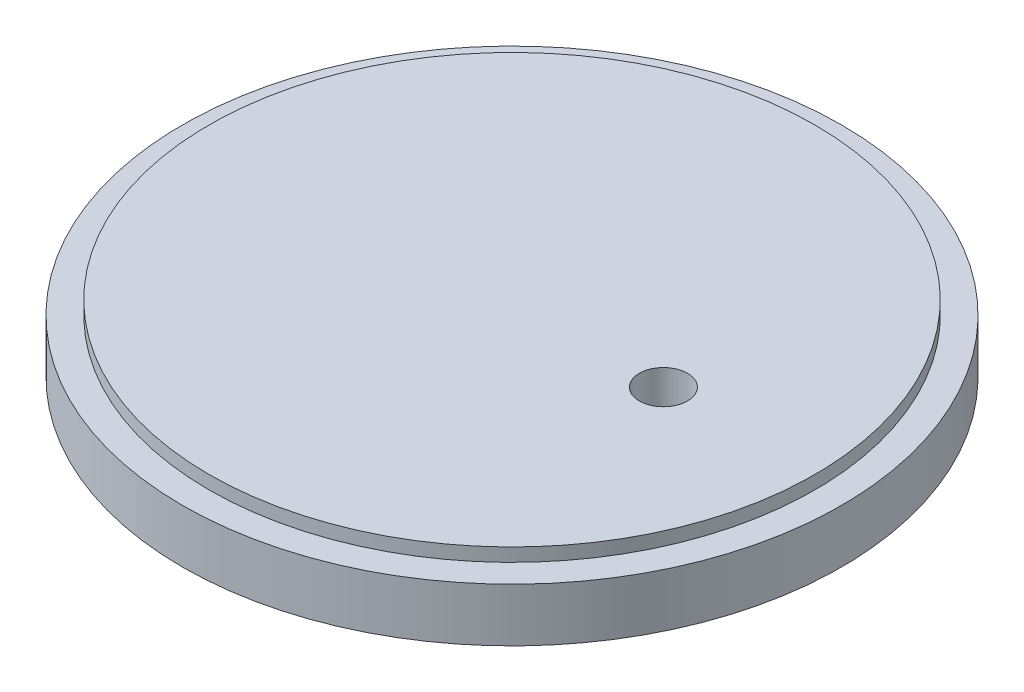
ISO-10303-21;
HEADER;
FILE_DESCRIPTION(('STEP AP214'),'2;1');
FILE_NAME('part.step','',(''),(''),'','','');
FILE_SCHEMA(('AUTOMOTIVE_DESIGN { 1 0 10303 214 1 1 1 1 }'));
ENDSEC;
DATA;
#1=APPLICATION_CONTEXT('core data for automotive mechanical design processes');
#2=APPLICATION_PROTOCOL_DEFINITION('international standard','automotive_design',2000,#1);
#3=PRODUCT_CONTEXT('',#1,'mechanical');
#4=PRODUCT('Part','Part','',(#3));
#5=PRODUCT_RELATED_PRODUCT_CATEGORY('part','',(#4));
#6=PRODUCT_DEFINITION_FORMATION('','',#4);
#7=PRODUCT_DEFINITION_CONTEXT('part definition',#1,'design');
#8=PRODUCT_DEFINITION('design','',#6,#7);
#9=PRODUCT_DEFINITION_SHAPE('','',#8);
#10=(LENGTH_UNIT() NAMED_UNIT(*) SI_UNIT(.MILLI.,.METRE.));
#11=(NAMED_UNIT(*) PLANE_ANGLE_UNIT() SI_UNIT($,.RADIAN.));
#12=(NAMED_UNIT(*) SI_UNIT($,.STERADIAN.) SOLID_ANGLE_UNIT());
#13=UNCERTAINTY_MEASURE_WITH_UNIT(LENGTH_MEASURE(1.E-05),#10,'distance_accuracy_value','');
#14=(GEOMETRIC_REPRESENTATION_CONTEXT(3) GLOBAL_UNCERTAINTY_ASSIGNED_CONTEXT((#13)) GLOBAL_UNIT_ASSIGNED_CONTEXT((#10,
#11,#12)) REPRESENTATION_CONTEXT('',''));
#15=CARTESIAN_POINT('',(0.,0.,0.));
#16=DIRECTION('',(0.,0.,1.));
#17=DIRECTION('',(1.,0.,0.));
#18=AXIS2_PLACEMENT_3D('',#15,#16,#17);
#19=CARTESIAN_POINT('',(0.,-3.75,0.));
#20=DIRECTION('',(0.,-1.,0.));
#21=DIRECTION('',(0.,0.,-1.));
#22=AXIS2_PLACEMENT_3D('',#19,#20,#21);
#23=PLANE('',#22);
#24=CARTESIAN_POINT('',(17.,-3.75,0.));
#25=DIRECTION('',(0.,-1.,0.));
#26=DIRECTION('',(0.,0.,-1.));
#27=AXIS2_PLACEMENT_3D('',#24,#25,#26);
#28=CIRCLE('',#27,5.);
#29=CARTESIAN_POINT('',(17.,-3.75,-5.));
#30=VERTEX_POINT('',#29);
#31=EDGE_CURVE('E53',#30,#30,#28,.T.);
#32=ORIENTED_EDGE('',*,*,#31,.F.);
#33=EDGE_LOOP('',(#32));
#34=FACE_BOUND('',#33,.T.);
#35=CARTESIAN_POINT('',(0.,-3.75,0.));
#36=DIRECTION('',(0.,-1.,0.));
#37=DIRECTION('',(0.,0.,-1.));
#38=AXIS2_PLACEMENT_3D('',#35,#36,#37);
#39=CIRCLE('',#38,37.);
#40=CARTESIAN_POINT('',(0.,-3.75,-37.));
#41=VERTEX_POINT('',#40);
#42=EDGE_CURVE('E10',#41,#41,#39,.T.);
#43=ORIENTED_EDGE('',*,*,#42,.T.);
#44=EDGE_LOOP('',(#43));
#45=FACE_BOUND('',#44,.T.);
#46=ADVANCED_FACE('F28',(#34,#45),#23,.T.);
#47=CARTESIAN_POINT('',(0.,-57.0799982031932,0.));
#48=DIRECTION('',(0.,-1.,0.));
#49=DIRECTION('',(0.,0.,-1.));
#50=AXIS2_PLACEMENT_3D('',#47,#48,#49);
#51=CYLINDRICAL_SURFACE('',#50,37.);
#52=CARTESIAN_POINT('',(0.,2.25,0.));
#53=DIRECTION('',(0.,-1.,0.));
#54=DIRECTION('',(0.,0.,-1.));
#55=AXIS2_PLACEMENT_3D('',#52,#53,#54);
#56=CIRCLE('',#55,37.);
#57=CARTESIAN_POINT('',(0.,2.25,-37.));
#58=VERTEX_POINT('',#57);
#59=EDGE_CURVE('E34',#58,#58,#56,.T.);
#60=ORIENTED_EDGE('',*,*,#59,.T.);
#61=EDGE_LOOP('',(#60));
#62=FACE_BOUND('',#61,.T.);
#63=ORIENTED_EDGE('',*,*,#42,.F.);
#64=EDGE_LOOP('',(#63));
#65=FACE_BOUND('',#64,.T.);
#66=ADVANCED_FACE('F60',(#62,#65),#51,.T.);
#67=CARTESIAN_POINT('',(37.,2.25,0.));
#68=DIRECTION('',(0.,1.,0.));
#69=DIRECTION('',(0.,0.,1.));
#70=AXIS2_PLACEMENT_3D('',#67,#68,#69);
#71=PLANE('',#70);
#72=CARTESIAN_POINT('',(0.,2.25,0.));
#73=DIRECTION('',(0.,-1.,0.));
#74=DIRECTION('',(0.,0.,-1.));
#75=AXIS2_PLACEMENT_3D('',#72,#73,#74);
#76=CIRCLE('',#75,34.);
#77=CARTESIAN_POINT('',(0.,2.25,-34.));
#78=VERTEX_POINT('',#77);
#79=EDGE_CURVE('E38',#78,#78,#76,.T.);
#80=ORIENTED_EDGE('',*,*,#79,.T.);
#81=EDGE_LOOP('',(#80));
#82=FACE_BOUND('',#81,.T.);
#83=ORIENTED_EDGE('',*,*,#59,.F.);
#84=EDGE_LOOP('',(#83));
#85=FACE_BOUND('',#84,.T.);
#86=ADVANCED_FACE('F64',(#82,#85),#71,.T.);
#87=CARTESIAN_POINT('',(0.,-57.0799982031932,0.));
#88=DIRECTION('',(0.,-1.,0.));
#89=DIRECTION('',(0.,0.,-1.));
#90=AXIS2_PLACEMENT_3D('',#87,#88,#89);
#91=CYLINDRICAL_SURFACE('',#90,34.);
#92=CARTESIAN_POINT('',(0.,3.75,0.));
#93=DIRECTION('',(0.,-1.,0.));
#94=DIRECTION('',(0.,0.,-1.));
#95=AXIS2_PLACEMENT_3D('',#92,#93,#94);
#96=CIRCLE('',#95,34.);
#97=CARTESIAN_POINT('',(0.,3.75,-34.));
#98=VERTEX_POINT('',#97);
#99=EDGE_CURVE('E42',#98,#98,#96,.T.);
#100=ORIENTED_EDGE('',*,*,#99,.T.);
#101=EDGE_LOOP('',(#100));
#102=FACE_BOUND('',#101,.T.);
#103=ORIENTED_EDGE('',*,*,#79,.F.);
#104=EDGE_LOOP('',(#103));
#105=FACE_BOUND('',#104,.T.);
#106=ADVANCED_FACE('F68',(#102,#105),#91,.T.);
#107=CARTESIAN_POINT('',(34.,3.75,0.));
#108=DIRECTION('',(0.,1.,0.));
#109=DIRECTION('',(0.,0.,1.));
#110=AXIS2_PLACEMENT_3D('',#107,#108,#109);
#111=PLANE('',#110);
#112=CARTESIAN_POINT('',(17.,3.75,0.));
#113=DIRECTION('',(0.,-1.,0.));
#114=DIRECTION('',(0.,0.,-1.));
#115=AXIS2_PLACEMENT_3D('',#112,#113,#114);
#116=CIRCLE('',#115,2.7);
#117=CARTESIAN_POINT('',(17.,3.75,-2.7));
#118=VERTEX_POINT('',#117);
#119=EDGE_CURVE('E47',#118,#118,#116,.T.);
#120=ORIENTED_EDGE('',*,*,#119,.T.);
#121=EDGE_LOOP('',(#120));
#122=FACE_BOUND('',#121,.T.);
#123=ORIENTED_EDGE('',*,*,#99,.F.);
#124=EDGE_LOOP('',(#123));
#125=FACE_BOUND('',#124,.T.);
#126=ADVANCED_FACE('F75',(#122,#125),#111,.T.);
#127=CARTESIAN_POINT('',(17.,-3.75,0.));
#128=DIRECTION('',(0.,-1.,0.));
#129=DIRECTION('',(0.,0.,-1.));
#130=AXIS2_PLACEMENT_3D('',#127,#128,#129);
#131=CYLINDRICAL_SURFACE('',#130,2.7);
#132=ORIENTED_EDGE('',*,*,#119,.F.);
#133=EDGE_LOOP('',(#132));
#134=FACE_BOUND('',#133,.T.);
#135=CARTESIAN_POINT('',(17.,-1.10415266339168,0.));
#136=DIRECTION('',(0.,-1.,0.));
#137=DIRECTION('',(0.,0.,-1.));
#138=AXIS2_PLACEMENT_3D('',#135,#136,#137);
#139=CIRCLE('',#138,2.7);
#140=CARTESIAN_POINT('',(17.,-1.10415266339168,-2.7));
#141=VERTEX_POINT('',#140);
#142=EDGE_CURVE('E50',#141,#141,#139,.T.);
#143=ORIENTED_EDGE('',*,*,#142,.T.);
#144=EDGE_LOOP('',(#143));
#145=FACE_BOUND('',#144,.T.);
#146=ADVANCED_FACE('F79',(#134,#145),#131,.F.);
#147=CARTESIAN_POINT('',(17.,-3.75,0.));
#148=DIRECTION('',(0.,-1.,0.));
#149=DIRECTION('',(0.,0.,-1.));
#150=AXIS2_PLACEMENT_3D('',#147,#148,#149);
#151=CONICAL_SURFACE('',#150,5.,0.715584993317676);
#152=ORIENTED_EDGE('',*,*,#142,.F.);
#153=EDGE_LOOP('',(#152));
#154=FACE_BOUND('',#153,.T.);
#155=ORIENTED_EDGE('',*,*,#31,.T.);
#156=EDGE_LOOP('',(#155));
#157=FACE_BOUND('',#156,.T.);
#158=ADVANCED_FACE('F57',(#154,#157),#151,.F.);
#159=CLOSED_SHELL('',(#46,#66,#86,#106,#126,#146,#158));
#160=MANIFOLD_SOLID_BREP('B2',#159);
#161=ADVANCED_BREP_SHAPE_REPRESENTATION('',(#18,#160),#14);
#162=SHAPE_DEFINITION_REPRESENTATION(#9,#161);
ENDSEC;
END-ISO-10303-21;
